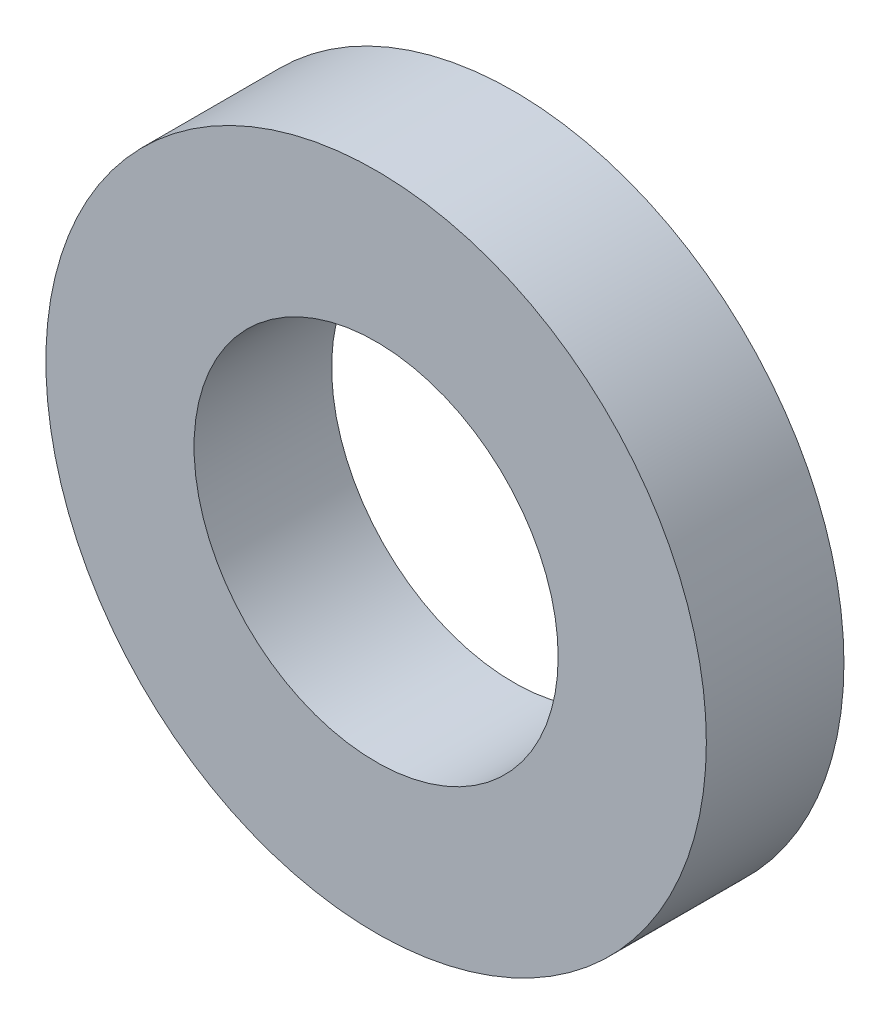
from build123d import *

# Parameters (mm, degrees)
SKETCH1_R      = 3.9624
SKETCH1_R_2    = 2.1844
EXTRUDE1_DEPTH = 1.651


with BuildPart() as part:
    # Sketch1 → Extrude1 (new body)
    with BuildSketch(Plane.XY):
        Circle(SKETCH1_R)
        Circle(SKETCH1_R_2, mode=Mode.SUBTRACT)
    extrude(amount=-EXTRUDE1_DEPTH)


solid = part.part
